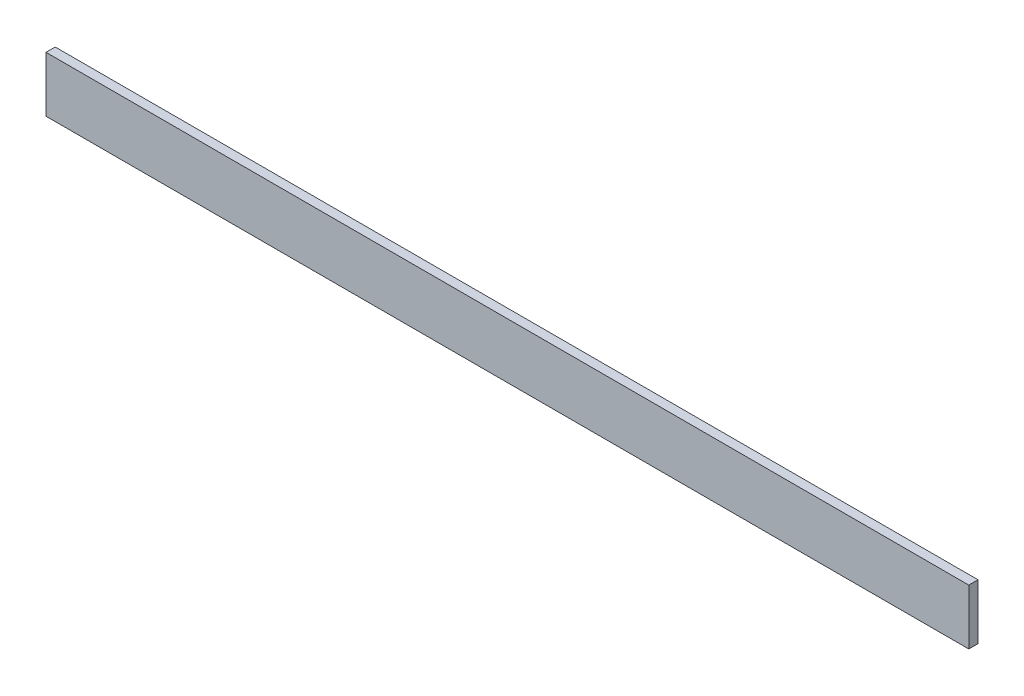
ISO-10303-21;
HEADER;
FILE_DESCRIPTION(('STEP AP214'),'2;1');
FILE_NAME('part.step','',(''),(''),'','','');
FILE_SCHEMA(('AUTOMOTIVE_DESIGN { 1 0 10303 214 1 1 1 1 }'));
ENDSEC;
DATA;
#1=APPLICATION_CONTEXT('core data for automotive mechanical design processes');
#2=APPLICATION_PROTOCOL_DEFINITION('international standard','automotive_design',2000,#1);
#3=PRODUCT_CONTEXT('',#1,'mechanical');
#4=PRODUCT('Part','Part','',(#3));
#5=PRODUCT_RELATED_PRODUCT_CATEGORY('part','',(#4));
#6=PRODUCT_DEFINITION_FORMATION('','',#4);
#7=PRODUCT_DEFINITION_CONTEXT('part definition',#1,'design');
#8=PRODUCT_DEFINITION('design','',#6,#7);
#9=PRODUCT_DEFINITION_SHAPE('','',#8);
#10=(LENGTH_UNIT() NAMED_UNIT(*) SI_UNIT(.MILLI.,.METRE.));
#11=(NAMED_UNIT(*) PLANE_ANGLE_UNIT() SI_UNIT($,.RADIAN.));
#12=(NAMED_UNIT(*) SI_UNIT($,.STERADIAN.) SOLID_ANGLE_UNIT());
#13=UNCERTAINTY_MEASURE_WITH_UNIT(LENGTH_MEASURE(1.E-05),#10,'distance_accuracy_value','');
#14=(GEOMETRIC_REPRESENTATION_CONTEXT(3) GLOBAL_UNCERTAINTY_ASSIGNED_CONTEXT((#13)) GLOBAL_UNIT_ASSIGNED_CONTEXT((#10,
#11,#12)) REPRESENTATION_CONTEXT('',''));
#15=CARTESIAN_POINT('',(0.,0.,0.));
#16=DIRECTION('',(0.,0.,1.));
#17=DIRECTION('',(1.,0.,0.));
#18=AXIS2_PLACEMENT_3D('',#15,#16,#17);
#19=CARTESIAN_POINT('',(0.,0.,9.99999999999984));
#20=DIRECTION('',(1.00000000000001,0.,0.));
#21=DIRECTION('',(0.,0.,-1.));
#22=AXIS2_PLACEMENT_3D('',#19,#20,#21);
#23=PLANE('',#22);
#24=DIRECTION('',(0.,-1.00000000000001,0.));
#25=VECTOR('',#24,1.);
#26=CARTESIAN_POINT('',(0.,0.,-1.66533453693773E-13));
#27=LINE('',#26,#25);
#28=CARTESIAN_POINT('',(0.,60.0000000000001,0.));
#29=VERTEX_POINT('',#28);
#30=CARTESIAN_POINT('',(0.,0.,-1.66533453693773E-13));
#31=VERTEX_POINT('',#30);
#32=EDGE_CURVE('E80',#29,#31,#27,.T.);
#33=ORIENTED_EDGE('',*,*,#32,.T.);
#34=DIRECTION('',(0.,0.,-1.));
#35=VECTOR('',#34,1.);
#36=CARTESIAN_POINT('',(0.,0.,9.99999999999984));
#37=LINE('',#36,#35);
#38=CARTESIAN_POINT('',(0.,0.,9.99999999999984));
#39=VERTEX_POINT('',#38);
#40=EDGE_CURVE('E11',#39,#31,#37,.T.);
#41=ORIENTED_EDGE('',*,*,#40,.F.);
#42=DIRECTION('',(0.,-1.00000000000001,0.));
#43=VECTOR('',#42,1.);
#44=CARTESIAN_POINT('',(0.,0.,9.99999999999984));
#45=LINE('',#44,#43);
#46=CARTESIAN_POINT('',(0.,60.0000000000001,10.));
#47=VERTEX_POINT('',#46);
#48=EDGE_CURVE('E99',#47,#39,#45,.T.);
#49=ORIENTED_EDGE('',*,*,#48,.F.);
#50=DIRECTION('',(0.,0.,-1.));
#51=VECTOR('',#50,1.);
#52=CARTESIAN_POINT('',(0.,60.0000000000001,10.));
#53=LINE('',#52,#51);
#54=EDGE_CURVE('E92',#47,#29,#53,.T.);
#55=ORIENTED_EDGE('',*,*,#54,.T.);
#56=EDGE_LOOP('',(#33,#41,#49,#55));
#57=FACE_BOUND('',#56,.T.);
#58=ADVANCED_FACE('F36',(#57),#23,.F.);
#59=CARTESIAN_POINT('',(0.,0.,9.99999999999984));
#60=DIRECTION('',(0.,1.00000000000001,0.));
#61=DIRECTION('',(0.,0.,1.));
#62=AXIS2_PLACEMENT_3D('',#59,#60,#61);
#63=PLANE('',#62);
#64=DIRECTION('',(1.00000000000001,0.,0.));
#65=VECTOR('',#64,1.);
#66=CARTESIAN_POINT('',(0.,0.,-1.66533453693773E-13));
#67=LINE('',#66,#65);
#68=CARTESIAN_POINT('',(1000.00000000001,0.,1.66533453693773E-13));
#69=VERTEX_POINT('',#68);
#70=EDGE_CURVE('E76',#31,#69,#67,.T.);
#71=ORIENTED_EDGE('',*,*,#70,.T.);
#72=DIRECTION('',(0.,0.,-1.));
#73=VECTOR('',#72,1.);
#74=CARTESIAN_POINT('',(1000.00000000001,0.,10.0000000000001));
#75=LINE('',#74,#73);
#76=CARTESIAN_POINT('',(1000.00000000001,0.,10.0000000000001));
#77=VERTEX_POINT('',#76);
#78=EDGE_CURVE('E43',#77,#69,#75,.T.);
#79=ORIENTED_EDGE('',*,*,#78,.F.);
#80=DIRECTION('',(1.00000000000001,0.,0.));
#81=VECTOR('',#80,1.);
#82=CARTESIAN_POINT('',(0.,0.,9.99999999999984));
#83=LINE('',#82,#81);
#84=EDGE_CURVE('E88',#39,#77,#83,.T.);
#85=ORIENTED_EDGE('',*,*,#84,.F.);
#86=ORIENTED_EDGE('',*,*,#40,.T.);
#87=EDGE_LOOP('',(#71,#79,#85,#86));
#88=FACE_BOUND('',#87,.T.);
#89=ADVANCED_FACE('F87',(#88),#63,.F.);
#90=CARTESIAN_POINT('',(1000.00000000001,0.,10.0000000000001));
#91=DIRECTION('',(-1.00000000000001,0.,0.));
#92=DIRECTION('',(0.,0.,1.));
#93=AXIS2_PLACEMENT_3D('',#90,#91,#92);
#94=PLANE('',#93);
#95=DIRECTION('',(0.,1.00000000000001,0.));
#96=VECTOR('',#95,1.);
#97=CARTESIAN_POINT('',(1000.00000000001,0.,1.66533453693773E-13));
#98=LINE('',#97,#96);
#99=CARTESIAN_POINT('',(1000.00000000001,59.9999999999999,1.66533453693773E-13));
#100=VERTEX_POINT('',#99);
#101=EDGE_CURVE('E81',#69,#100,#98,.T.);
#102=ORIENTED_EDGE('',*,*,#101,.T.);
#103=DIRECTION('',(0.,0.,-1.));
#104=VECTOR('',#103,1.);
#105=CARTESIAN_POINT('',(1000.00000000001,59.9999999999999,10.0000000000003));
#106=LINE('',#105,#104);
#107=CARTESIAN_POINT('',(1000.00000000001,59.9999999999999,10.0000000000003));
#108=VERTEX_POINT('',#107);
#109=EDGE_CURVE('E108',#108,#100,#106,.T.);
#110=ORIENTED_EDGE('',*,*,#109,.F.);
#111=DIRECTION('',(0.,1.00000000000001,0.));
#112=VECTOR('',#111,1.);
#113=CARTESIAN_POINT('',(1000.00000000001,0.,10.0000000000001));
#114=LINE('',#113,#112);
#115=EDGE_CURVE('E55',#77,#108,#114,.T.);
#116=ORIENTED_EDGE('',*,*,#115,.F.);
#117=ORIENTED_EDGE('',*,*,#78,.T.);
#118=EDGE_LOOP('',(#102,#110,#116,#117));
#119=FACE_BOUND('',#118,.T.);
#120=ADVANCED_FACE('F111',(#119),#94,.F.);
#121=CARTESIAN_POINT('',(0.,60.0000000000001,10.));
#122=DIRECTION('',(0.,-1.00000000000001,0.));
#123=DIRECTION('',(0.,0.,-1.));
#124=AXIS2_PLACEMENT_3D('',#121,#122,#123);
#125=PLANE('',#124);
#126=DIRECTION('',(-1.00000000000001,0.,0.));
#127=VECTOR('',#126,1.);
#128=CARTESIAN_POINT('',(0.,60.0000000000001,0.));
#129=LINE('',#128,#127);
#130=EDGE_CURVE('E96',#100,#29,#129,.T.);
#131=ORIENTED_EDGE('',*,*,#130,.T.);
#132=ORIENTED_EDGE('',*,*,#54,.F.);
#133=DIRECTION('',(-1.00000000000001,0.,0.));
#134=VECTOR('',#133,1.);
#135=CARTESIAN_POINT('',(0.,60.0000000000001,10.));
#136=LINE('',#135,#134);
#137=EDGE_CURVE('E50',#108,#47,#136,.T.);
#138=ORIENTED_EDGE('',*,*,#137,.F.);
#139=ORIENTED_EDGE('',*,*,#109,.T.);
#140=EDGE_LOOP('',(#131,#132,#138,#139));
#141=FACE_BOUND('',#140,.T.);
#142=ADVANCED_FACE('F113',(#141),#125,.F.);
#143=CARTESIAN_POINT('',(0.,60.0000000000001,10.));
#144=DIRECTION('',(0.,0.,-1.));
#145=DIRECTION('',(-1.00000000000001,0.,0.));
#146=AXIS2_PLACEMENT_3D('',#143,#144,#145);
#147=PLANE('',#146);
#148=ORIENTED_EDGE('',*,*,#48,.T.);
#149=ORIENTED_EDGE('',*,*,#84,.T.);
#150=ORIENTED_EDGE('',*,*,#115,.T.);
#151=ORIENTED_EDGE('',*,*,#137,.T.);
#152=EDGE_LOOP('',(#148,#149,#150,#151));
#153=FACE_BOUND('',#152,.T.);
#154=ADVANCED_FACE('F114',(#153),#147,.F.);
#155=CARTESIAN_POINT('',(0.,60.0000000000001,0.));
#156=DIRECTION('',(0.,0.,-1.));
#157=DIRECTION('',(-1.00000000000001,0.,0.));
#158=AXIS2_PLACEMENT_3D('',#155,#156,#157);
#159=PLANE('',#158);
#160=ORIENTED_EDGE('',*,*,#32,.F.);
#161=ORIENTED_EDGE('',*,*,#130,.F.);
#162=ORIENTED_EDGE('',*,*,#101,.F.);
#163=ORIENTED_EDGE('',*,*,#70,.F.);
#164=EDGE_LOOP('',(#160,#161,#162,#163));
#165=FACE_BOUND('',#164,.T.);
#166=ADVANCED_FACE('F77',(#165),#159,.T.);
#167=CLOSED_SHELL('',(#58,#89,#120,#142,#154,#166));
#168=MANIFOLD_SOLID_BREP('B2',#167);
#169=ADVANCED_BREP_SHAPE_REPRESENTATION('',(#18,#168),#14);
#170=SHAPE_DEFINITION_REPRESENTATION(#9,#169);
ENDSEC;
END-ISO-10303-21;
